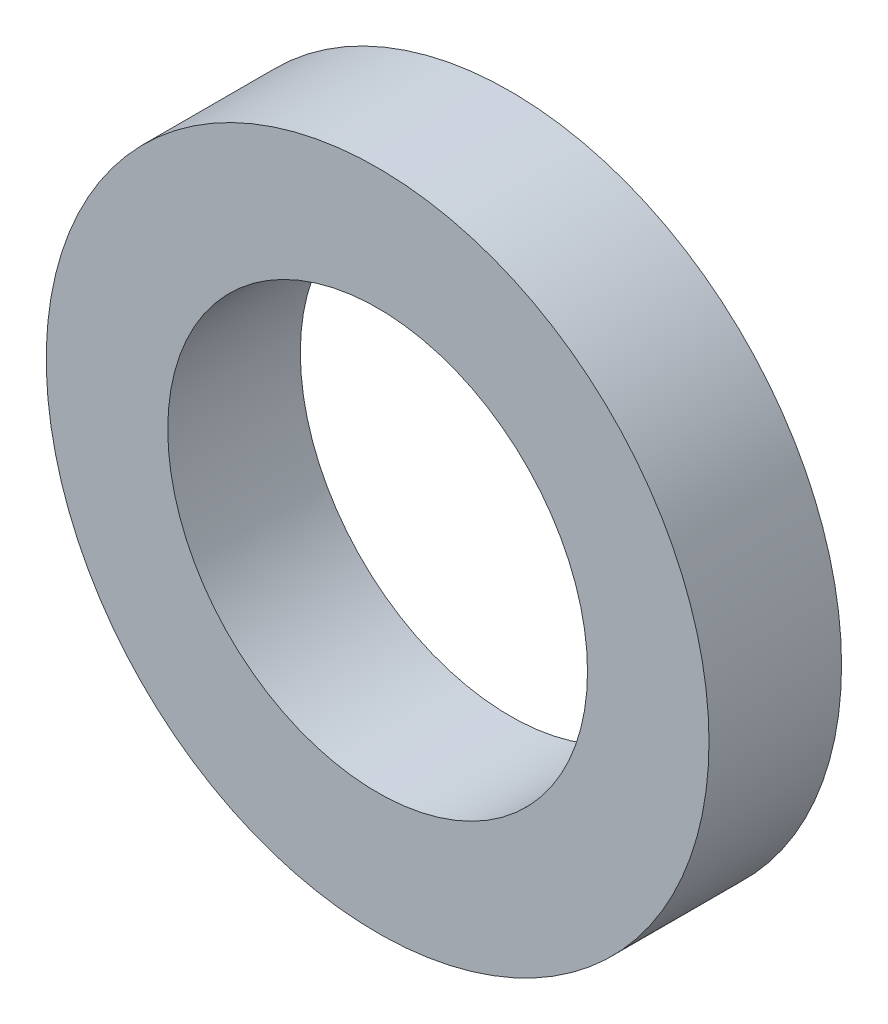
ISO-10303-21;
HEADER;
FILE_DESCRIPTION(('STEP AP214'),'2;1');
FILE_NAME('part.step','',(''),(''),'','','');
FILE_SCHEMA(('AUTOMOTIVE_DESIGN { 1 0 10303 214 1 1 1 1 }'));
ENDSEC;
DATA;
#1=APPLICATION_CONTEXT('core data for automotive mechanical design processes');
#2=APPLICATION_PROTOCOL_DEFINITION('international standard','automotive_design',2000,#1);
#3=PRODUCT_CONTEXT('',#1,'mechanical');
#4=PRODUCT('Part','Part','',(#3));
#5=PRODUCT_RELATED_PRODUCT_CATEGORY('part','',(#4));
#6=PRODUCT_DEFINITION_FORMATION('','',#4);
#7=PRODUCT_DEFINITION_CONTEXT('part definition',#1,'design');
#8=PRODUCT_DEFINITION('design','',#6,#7);
#9=PRODUCT_DEFINITION_SHAPE('','',#8);
#10=(LENGTH_UNIT() NAMED_UNIT(*) SI_UNIT(.MILLI.,.METRE.));
#11=(NAMED_UNIT(*) PLANE_ANGLE_UNIT() SI_UNIT($,.RADIAN.));
#12=(NAMED_UNIT(*) SI_UNIT($,.STERADIAN.) SOLID_ANGLE_UNIT());
#13=UNCERTAINTY_MEASURE_WITH_UNIT(LENGTH_MEASURE(1.E-05),#10,'distance_accuracy_value','');
#14=(GEOMETRIC_REPRESENTATION_CONTEXT(3) GLOBAL_UNCERTAINTY_ASSIGNED_CONTEXT((#13)) GLOBAL_UNIT_ASSIGNED_CONTEXT((#10,
#11,#12)) REPRESENTATION_CONTEXT('',''));
#15=CARTESIAN_POINT('',(0.,0.,0.));
#16=DIRECTION('',(0.,0.,1.));
#17=DIRECTION('',(1.,0.,0.));
#18=AXIS2_PLACEMENT_3D('',#15,#16,#17);
#19=CARTESIAN_POINT('',(17.14,214.32,-27.));
#20=DIRECTION('',(0.,0.,1.));
#21=DIRECTION('',(1.,0.,0.));
#22=AXIS2_PLACEMENT_3D('',#19,#20,#21);
#23=CYLINDRICAL_SURFACE('',#22,7.50000000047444);
#24=CARTESIAN_POINT('',(17.14,214.32,-27.));
#25=DIRECTION('',(0.,0.,1.));
#26=DIRECTION('',(1.,0.,0.));
#27=AXIS2_PLACEMENT_3D('',#24,#25,#26);
#28=CIRCLE('',#27,7.50000000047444);
#29=CARTESIAN_POINT('',(24.6400000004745,214.32,-27.));
#30=VERTEX_POINT('',#29);
#31=EDGE_CURVE('E32',#30,#30,#28,.F.);
#32=CARTESIAN_POINT('',(17.14,214.32,-24.));
#33=DIRECTION('',(0.,0.,1.));
#34=DIRECTION('',(1.,0.,0.));
#35=AXIS2_PLACEMENT_3D('',#32,#33,#34);
#36=CIRCLE('',#35,7.50000000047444);
#37=CARTESIAN_POINT('',(24.6400000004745,214.32,-24.));
#38=VERTEX_POINT('',#37);
#39=EDGE_CURVE('E10',#38,#38,#36,.F.);
#40=CARTESIAN_POINT('',(24.6400000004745,214.32,-27.));
#41=CARTESIAN_POINT('',(24.6400000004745,214.32,-26.96875));
#42=CARTESIAN_POINT('',(24.6400000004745,214.32,-26.9375));
#43=CARTESIAN_POINT('',(24.6400000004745,214.32,-26.875));
#44=CARTESIAN_POINT('',(24.6400000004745,214.32,-26.84375));
#45=CARTESIAN_POINT('',(24.6400000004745,214.32,-26.78125));
#46=CARTESIAN_POINT('',(24.6400000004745,214.32,-26.75));
#47=CARTESIAN_POINT('',(24.6400000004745,214.32,-26.6875));
#48=CARTESIAN_POINT('',(24.6400000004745,214.32,-26.65625));
#49=CARTESIAN_POINT('',(24.6400000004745,214.32,-26.59375));
#50=CARTESIAN_POINT('',(24.6400000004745,214.32,-26.5625));
#51=CARTESIAN_POINT('',(24.6400000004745,214.32,-26.5));
#52=CARTESIAN_POINT('',(24.6400000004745,214.32,-26.46875));
#53=CARTESIAN_POINT('',(24.6400000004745,214.32,-26.40625));
#54=CARTESIAN_POINT('',(24.6400000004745,214.32,-26.375));
#55=CARTESIAN_POINT('',(24.6400000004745,214.32,-26.3125));
#56=CARTESIAN_POINT('',(24.6400000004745,214.32,-26.28125));
#57=CARTESIAN_POINT('',(24.6400000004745,214.32,-26.21875));
#58=CARTESIAN_POINT('',(24.6400000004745,214.32,-26.1875));
#59=CARTESIAN_POINT('',(24.6400000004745,214.32,-26.125));
#60=CARTESIAN_POINT('',(24.6400000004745,214.32,-26.09375));
#61=CARTESIAN_POINT('',(24.6400000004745,214.32,-26.03125));
#62=CARTESIAN_POINT('',(24.6400000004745,214.32,-26.));
#63=CARTESIAN_POINT('',(24.6400000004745,214.32,-25.9375));
#64=CARTESIAN_POINT('',(24.6400000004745,214.32,-25.90625));
#65=CARTESIAN_POINT('',(24.6400000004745,214.32,-25.84375));
#66=CARTESIAN_POINT('',(24.6400000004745,214.32,-25.8125));
#67=CARTESIAN_POINT('',(24.6400000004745,214.32,-25.75));
#68=CARTESIAN_POINT('',(24.6400000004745,214.32,-25.71875));
#69=CARTESIAN_POINT('',(24.6400000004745,214.32,-25.65625));
#70=CARTESIAN_POINT('',(24.6400000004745,214.32,-25.625));
#71=CARTESIAN_POINT('',(24.6400000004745,214.32,-25.5625));
#72=CARTESIAN_POINT('',(24.6400000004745,214.32,-25.53125));
#73=CARTESIAN_POINT('',(24.6400000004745,214.32,-25.46875));
#74=CARTESIAN_POINT('',(24.6400000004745,214.32,-25.4375));
#75=CARTESIAN_POINT('',(24.6400000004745,214.32,-25.375));
#76=CARTESIAN_POINT('',(24.6400000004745,214.32,-25.34375));
#77=CARTESIAN_POINT('',(24.6400000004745,214.32,-25.28125));
#78=CARTESIAN_POINT('',(24.6400000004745,214.32,-25.25));
#79=CARTESIAN_POINT('',(24.6400000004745,214.32,-25.1875));
#80=CARTESIAN_POINT('',(24.6400000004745,214.32,-25.15625));
#81=CARTESIAN_POINT('',(24.6400000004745,214.32,-25.09375));
#82=CARTESIAN_POINT('',(24.6400000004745,214.32,-25.0625));
#83=CARTESIAN_POINT('',(24.6400000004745,214.32,-25.));
#84=CARTESIAN_POINT('',(24.6400000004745,214.32,-24.96875));
#85=CARTESIAN_POINT('',(24.6400000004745,214.32,-24.90625));
#86=CARTESIAN_POINT('',(24.6400000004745,214.32,-24.875));
#87=CARTESIAN_POINT('',(24.6400000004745,214.32,-24.8125));
#88=CARTESIAN_POINT('',(24.6400000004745,214.32,-24.78125));
#89=CARTESIAN_POINT('',(24.6400000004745,214.32,-24.71875));
#90=CARTESIAN_POINT('',(24.6400000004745,214.32,-24.6875));
#91=CARTESIAN_POINT('',(24.6400000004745,214.32,-24.625));
#92=CARTESIAN_POINT('',(24.6400000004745,214.32,-24.59375));
#93=CARTESIAN_POINT('',(24.6400000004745,214.32,-24.53125));
#94=CARTESIAN_POINT('',(24.6400000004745,214.32,-24.5));
#95=CARTESIAN_POINT('',(24.6400000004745,214.32,-24.4375));
#96=CARTESIAN_POINT('',(24.6400000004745,214.32,-24.40625));
#97=CARTESIAN_POINT('',(24.6400000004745,214.32,-24.34375));
#98=CARTESIAN_POINT('',(24.6400000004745,214.32,-24.3125));
#99=CARTESIAN_POINT('',(24.6400000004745,214.32,-24.25));
#100=CARTESIAN_POINT('',(24.6400000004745,214.32,-24.21875));
#101=CARTESIAN_POINT('',(24.6400000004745,214.32,-24.15625));
#102=CARTESIAN_POINT('',(24.6400000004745,214.32,-24.125));
#103=CARTESIAN_POINT('',(24.6400000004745,214.32,-24.0625));
#104=CARTESIAN_POINT('',(24.6400000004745,214.32,-24.03125));
#105=CARTESIAN_POINT('',(24.6400000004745,214.32,-24.));
#106=B_SPLINE_CURVE_WITH_KNOTS('',3,(#40,#41,#42,#43,#44,#45,#46,#47,#48,#49,#50,#51,#52,#53,
#54,#55,#56,#57,#58,#59,#60,#61,#62,#63,#64,#65,#66,#67,#68,#69,#70,#71,#72,#73,#74,#75,#76,#77,
#78,#79,#80,#81,#82,#83,#84,#85,#86,#87,#88,#89,#90,#91,#92,#93,#94,#95,#96,#97,#98,#99,#100,
#101,#102,#103,#104,#105),.UNSPECIFIED.,.F.,.F.,(4,2,2,2,2,2,2,2,2,2,2,2,2,2,2,2,2,2,2,2,2,2,2,
2,2,2,2,2,2,2,2,2,4),(0.,0.0937499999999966,0.187499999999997,0.281249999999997,
0.374999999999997,0.468749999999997,0.562499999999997,0.656249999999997,0.749999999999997,
0.843749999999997,0.937499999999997,1.03125,1.125,1.21875,1.3125,1.40625,1.5,1.59375,1.6875,
1.78125,1.875,1.96875,2.0625,2.15625,2.25,2.34375,2.4375,2.53125,2.625,2.71875,2.8125,2.90625,
3.),.UNSPECIFIED.);
#107=EDGE_CURVE('BSEAM28',#30,#38,#106,.T.);
#108=ORIENTED_EDGE('',*,*,#31,.F.);
#109=ORIENTED_EDGE('',*,*,#39,.T.);
#110=ORIENTED_EDGE('',*,*,#107,.T.);
#111=ORIENTED_EDGE('',*,*,#107,.F.);
#112=EDGE_LOOP('',(#108,#110,#109,#111));
#113=FACE_BOUND('',#112,.T.);
#114=ADVANCED_FACE('F28',(#113),#23,.T.);
#115=CARTESIAN_POINT('',(26.236233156,220.018661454,-27.));
#116=DIRECTION('',(0.,0.,-1.));
#117=DIRECTION('',(-0.223818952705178,-0.974630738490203,0.));
#118=AXIS2_PLACEMENT_3D('',#115,#116,#117);
#119=PLANE('',#118);
#120=CARTESIAN_POINT('',(17.14,214.32,-27.));
#121=DIRECTION('',(0.,0.,-1.));
#122=DIRECTION('',(-1.,0.,0.));
#123=AXIS2_PLACEMENT_3D('',#120,#121,#122);
#124=CIRCLE('',#123,4.75);
#125=CARTESIAN_POINT('',(12.39,214.32,-27.));
#126=VERTEX_POINT('',#125);
#127=EDGE_CURVE('E43',#126,#126,#124,.T.);
#128=ORIENTED_EDGE('',*,*,#127,.F.);
#129=EDGE_LOOP('',(#128));
#130=FACE_BOUND('',#129,.T.);
#131=ORIENTED_EDGE('',*,*,#31,.T.);
#132=EDGE_LOOP('',(#131));
#133=FACE_BOUND('',#132,.T.);
#134=ADVANCED_FACE('F49',(#130,#133),#119,.T.);
#135=CARTESIAN_POINT('',(26.236233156,220.018661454,-24.));
#136=DIRECTION('',(0.,0.,-1.));
#137=DIRECTION('',(-0.223818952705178,-0.974630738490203,0.));
#138=AXIS2_PLACEMENT_3D('',#135,#136,#137);
#139=PLANE('',#138);
#140=CARTESIAN_POINT('',(17.14,214.32,-24.));
#141=DIRECTION('',(0.,0.,-1.));
#142=DIRECTION('',(-1.,0.,0.));
#143=AXIS2_PLACEMENT_3D('',#140,#141,#142);
#144=CIRCLE('',#143,4.75);
#145=CARTESIAN_POINT('',(12.39,214.32,-24.));
#146=VERTEX_POINT('',#145);
#147=EDGE_CURVE('E39',#146,#146,#144,.T.);
#148=ORIENTED_EDGE('',*,*,#147,.T.);
#149=EDGE_LOOP('',(#148));
#150=FACE_BOUND('',#149,.T.);
#151=ORIENTED_EDGE('',*,*,#39,.F.);
#152=EDGE_LOOP('',(#151));
#153=FACE_BOUND('',#152,.T.);
#154=ADVANCED_FACE('F30',(#150,#153),#139,.F.);
#155=CARTESIAN_POINT('',(17.14,214.32,-24.));
#156=DIRECTION('',(0.,0.,-1.));
#157=DIRECTION('',(-1.,0.,0.));
#158=AXIS2_PLACEMENT_3D('',#155,#156,#157);
#159=CYLINDRICAL_SURFACE('',#158,4.75);
#160=ORIENTED_EDGE('',*,*,#147,.F.);
#161=EDGE_LOOP('',(#160));
#162=FACE_BOUND('',#161,.T.);
#163=ORIENTED_EDGE('',*,*,#127,.T.);
#164=EDGE_LOOP('',(#163));
#165=FACE_BOUND('',#164,.T.);
#166=ADVANCED_FACE('F47',(#162,#165),#159,.F.);
#167=CLOSED_SHELL('',(#114,#134,#154,#166));
#168=MANIFOLD_SOLID_BREP('B2',#167);
#169=ADVANCED_BREP_SHAPE_REPRESENTATION('',(#18,#168),#14);
#170=SHAPE_DEFINITION_REPRESENTATION(#9,#169);
ENDSEC;
END-ISO-10303-21;
